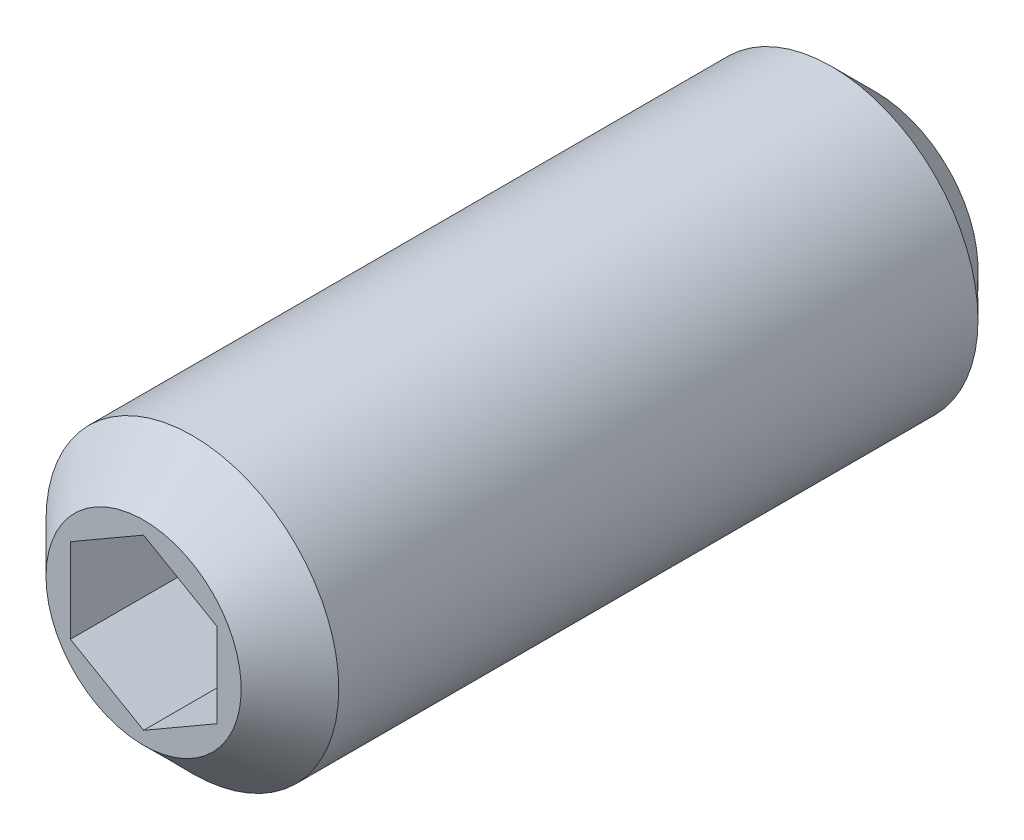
ISO-10303-21;
HEADER;
FILE_DESCRIPTION(('STEP AP214'),'2;1');
FILE_NAME('part.step','',(''),(''),'','','');
FILE_SCHEMA(('AUTOMOTIVE_DESIGN { 1 0 10303 214 1 1 1 1 }'));
ENDSEC;
DATA;
#1=APPLICATION_CONTEXT('core data for automotive mechanical design processes');
#2=APPLICATION_PROTOCOL_DEFINITION('international standard','automotive_design',2000,#1);
#3=PRODUCT_CONTEXT('',#1,'mechanical');
#4=PRODUCT('Part','Part','',(#3));
#5=PRODUCT_RELATED_PRODUCT_CATEGORY('part','',(#4));
#6=PRODUCT_DEFINITION_FORMATION('','',#4);
#7=PRODUCT_DEFINITION_CONTEXT('part definition',#1,'design');
#8=PRODUCT_DEFINITION('design','',#6,#7);
#9=PRODUCT_DEFINITION_SHAPE('','',#8);
#10=(LENGTH_UNIT() NAMED_UNIT(*) SI_UNIT(.MILLI.,.METRE.));
#11=(NAMED_UNIT(*) PLANE_ANGLE_UNIT() SI_UNIT($,.RADIAN.));
#12=(NAMED_UNIT(*) SI_UNIT($,.STERADIAN.) SOLID_ANGLE_UNIT());
#13=UNCERTAINTY_MEASURE_WITH_UNIT(LENGTH_MEASURE(1.E-05),#10,'distance_accuracy_value','');
#14=(GEOMETRIC_REPRESENTATION_CONTEXT(3) GLOBAL_UNCERTAINTY_ASSIGNED_CONTEXT((#13)) GLOBAL_UNIT_ASSIGNED_CONTEXT((#10,
#11,#12)) REPRESENTATION_CONTEXT('',''));
#15=CARTESIAN_POINT('',(0.,0.,0.));
#16=DIRECTION('',(0.,0.,1.));
#17=DIRECTION('',(1.,0.,0.));
#18=AXIS2_PLACEMENT_3D('',#15,#16,#17);
#19=CARTESIAN_POINT('',(3.73333323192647E-10,1.7397246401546E-08,1.75));
#20=DIRECTION('',(2.13333329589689E-10,-5.87163419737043E-11,1.));
#21=DIRECTION('',(0.,1.,5.87163419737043E-11));
#22=AXIS2_PLACEMENT_3D('',#19,#20,#21);
#23=SPHERICAL_SURFACE('',#22,1.75);
#24=CARTESIAN_POINT('',(0.,0.,0.));
#25=VERTEX_POINT('',#24);
#26=VERTEX_LOOP('',#25);
#27=FACE_BOUND('',#26,.T.);
#28=CARTESIAN_POINT('',(2.1333332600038E-10,1.74412836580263E-08,1.));
#29=DIRECTION('',(2.13333329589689E-10,-5.87163419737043E-11,1.));
#30=DIRECTION('',(1.,0.,-2.13333329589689E-10));
#31=AXIS2_PLACEMENT_3D('',#28,#29,#30);
#32=CIRCLE('',#31,1.58113883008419);
#33=CARTESIAN_POINT('',(1.58113883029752,1.74412836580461E-08,0.99999999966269));
#34=VERTEX_POINT('',#33);
#35=EDGE_CURVE('E18',#34,#34,#32,.F.);
#36=ORIENTED_EDGE('',*,*,#35,.T.);
#37=EDGE_LOOP('',(#36));
#38=FACE_BOUND('',#37,.T.);
#39=ADVANCED_FACE('F14',(#27,#38),#23,.T.);
#40=CARTESIAN_POINT('',(1.50000000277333,-1.75283540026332,12.9999999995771));
#41=DIRECTION('',(-2.13333329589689E-10,5.87163419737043E-11,-1.));
#42=DIRECTION('',(-1.,0.,2.13333329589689E-10));
#43=AXIS2_PLACEMENT_3D('',#40,#41,#42);
#44=PLANE('',#43);
#45=DIRECTION('',(-0.866025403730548,-0.500000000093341,1.5539391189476E-10));
#46=VECTOR('',#45,1.);
#47=CARTESIAN_POINT('',(-0.749999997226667,1.29903812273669,13.0000000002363));
#48=LINE('',#47,#46);
#49=CARTESIAN_POINT('',(2.35004088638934E-09,1.73205082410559,13.0000000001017));
#50=VERTEX_POINT('',#49);
#51=CARTESIAN_POINT('',(-1.49999999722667,0.866025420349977,13.0000000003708));
#52=VERTEX_POINT('',#51);
#53=EDGE_CURVE('E83',#50,#52,#48,.T.);
#54=ORIENTED_EDGE('',*,*,#53,.T.);
#55=DIRECTION('',(0.,-1.,-5.87163419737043E-11));
#56=VECTOR('',#55,1.);
#57=CARTESIAN_POINT('',(-1.49999999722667,1.6736687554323E-08,13.00000000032));
#58=LINE('',#57,#56);
#59=CARTESIAN_POINT('',(-1.49999999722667,-0.866025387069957,13.0000000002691));
#60=VERTEX_POINT('',#59);
#61=EDGE_CURVE('E77',#52,#60,#58,.T.);
#62=ORIENTED_EDGE('',*,*,#61,.T.);
#63=DIRECTION('',(0.866025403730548,-0.500000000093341,-2.14110253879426E-10));
#64=VECTOR('',#63,1.);
#65=CARTESIAN_POINT('',(-0.749999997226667,-1.29903808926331,13.0000000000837));
#66=LINE('',#65,#64);
#67=CARTESIAN_POINT('',(3.19662575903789E-09,-1.73205079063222,12.9999999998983));
#68=VERTEX_POINT('',#67);
#69=EDGE_CURVE('E80',#60,#68,#66,.T.);
#70=ORIENTED_EDGE('',*,*,#69,.T.);
#71=DIRECTION('',(0.866025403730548,0.500000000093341,-1.5539391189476E-10));
#72=VECTOR('',#71,1.);
#73=CARTESIAN_POINT('',(0.750000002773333,-1.29903808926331,12.9999999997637));
#74=LINE('',#73,#72);
#75=CARTESIAN_POINT('',(1.50000000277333,-0.866025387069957,12.9999999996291));
#76=VERTEX_POINT('',#75);
#77=EDGE_CURVE('E95',#68,#76,#74,.T.);
#78=ORIENTED_EDGE('',*,*,#77,.T.);
#79=DIRECTION('',(0.,1.,5.87163419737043E-11));
#80=VECTOR('',#79,1.);
#81=CARTESIAN_POINT('',(1.50000000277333,1.67366875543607E-08,12.99999999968));
#82=LINE('',#81,#80);
#83=CARTESIAN_POINT('',(1.50000000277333,0.866025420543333,12.9999999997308));
#84=VERTEX_POINT('',#83);
#85=EDGE_CURVE('E101',#76,#84,#82,.T.);
#86=ORIENTED_EDGE('',*,*,#85,.T.);
#87=DIRECTION('',(-0.866025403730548,0.500000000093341,2.14110253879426E-10));
#88=VECTOR('',#87,1.);
#89=CARTESIAN_POINT('',(0.750000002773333,1.29903812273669,12.9999999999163));
#90=LINE('',#89,#88);
#91=EDGE_CURVE('E104',#84,#50,#90,.T.);
#92=ORIENTED_EDGE('',*,*,#91,.T.);
#93=EDGE_LOOP('',(#54,#62,#70,#78,#86,#92));
#94=FACE_BOUND('',#93,.T.);
#95=ADVANCED_FACE('F78',(#94),#44,.F.);
#96=CARTESIAN_POINT('',(-2.12519999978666,-2.13251273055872,1.00000000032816));
#97=DIRECTION('',(2.13333329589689E-10,-5.87163419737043E-11,1.));
#98=DIRECTION('',(1.,0.,-2.13333329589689E-10));
#99=AXIS2_PLACEMENT_3D('',#96,#97,#98);
#100=PLANE('',#99);
#101=ORIENTED_EDGE('',*,*,#35,.F.);
#102=EDGE_LOOP('',(#101));
#103=FACE_BOUND('',#102,.T.);
#104=CARTESIAN_POINT('',(2.1333332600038E-10,1.74412836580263E-08,1.));
#105=DIRECTION('',(2.13333329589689E-10,-5.87167550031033E-11,1.));
#106=DIRECTION('',(0.,1.,5.87167550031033E-11));
#107=AXIS2_PLACEMENT_3D('',#104,#105,#106);
#108=CIRCLE('',#107,2.1);
#109=CARTESIAN_POINT('',(2.1333332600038E-10,2.10000001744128,1.00000000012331));
#110=VERTEX_POINT('',#109);
#111=EDGE_CURVE('E121',#110,#110,#108,.T.);
#112=ORIENTED_EDGE('',*,*,#111,.F.);
#113=EDGE_LOOP('',(#112));
#114=FACE_BOUND('',#113,.T.);
#115=ADVANCED_FACE('F134',(#103,#114),#100,.F.);
#116=CARTESIAN_POINT('',(-1.49999999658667,-0.866025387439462,16.0000000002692));
#117=DIRECTION('',(-1.,0.,2.13333329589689E-10));
#118=DIRECTION('',(0.,1.,5.87163419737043E-11));
#119=AXIS2_PLACEMENT_3D('',#116,#117,#118);
#120=PLANE('',#119);
#121=DIRECTION('',(-2.13333329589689E-10,5.87163419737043E-11,-1.));
#122=VECTOR('',#121,1.);
#123=CARTESIAN_POINT('',(-1.49999999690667,-0.866025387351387,14.5000000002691));
#124=LINE('',#123,#122);
#125=CARTESIAN_POINT('',(-1.49999999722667,-0.866025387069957,16.0000000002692));
#126=VERTEX_POINT('',#125);
#127=EDGE_CURVE('E84',#126,#60,#124,.T.);
#128=ORIENTED_EDGE('',*,*,#127,.T.);
#129=ORIENTED_EDGE('',*,*,#61,.F.);
#130=DIRECTION('',(2.13333329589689E-10,-5.87163419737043E-11,1.));
#131=VECTOR('',#130,1.);
#132=CARTESIAN_POINT('',(-1.49999999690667,0.866025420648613,14.5000000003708));
#133=LINE('',#132,#131);
#134=CARTESIAN_POINT('',(-1.49999999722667,0.866025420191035,16.0000000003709));
#135=VERTEX_POINT('',#134);
#136=EDGE_CURVE('E54',#52,#135,#133,.T.);
#137=ORIENTED_EDGE('',*,*,#136,.T.);
#138=DIRECTION('',(0.,-1.,-5.87163419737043E-11));
#139=VECTOR('',#138,1.);
#140=CARTESIAN_POINT('',(-1.49999999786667,1.65605385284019E-08,16.00000000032));
#141=LINE('',#140,#139);
#142=EDGE_CURVE('E48',#135,#126,#141,.T.);
#143=ORIENTED_EDGE('',*,*,#142,.T.);
#144=EDGE_LOOP('',(#128,#129,#137,#143));
#145=FACE_BOUND('',#144,.T.);
#146=ADVANCED_FACE('F86',(#145),#120,.F.);
#147=CARTESIAN_POINT('',(3.41333326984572E-09,-1.73205079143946,15.9999999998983));
#148=DIRECTION('',(-0.500000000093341,-0.866025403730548,5.58168210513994E-11));
#149=DIRECTION('',(-0.866025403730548,0.500000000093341,2.14110253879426E-10));
#150=AXIS2_PLACEMENT_3D('',#147,#148,#149);
#151=PLANE('',#150);
#152=DIRECTION('',(-2.13333329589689E-10,5.87163419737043E-11,-1.));
#153=VECTOR('',#152,1.);
#154=CARTESIAN_POINT('',(3.09333327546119E-09,-1.73205079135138,14.4999999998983));
#155=LINE('',#154,#153);
#156=CARTESIAN_POINT('',(3.41333311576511E-09,-1.73205079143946,15.9999999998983));
#157=VERTEX_POINT('',#156);
#158=EDGE_CURVE('E92',#157,#68,#155,.T.);
#159=ORIENTED_EDGE('',*,*,#158,.T.);
#160=ORIENTED_EDGE('',*,*,#69,.F.);
#161=ORIENTED_EDGE('',*,*,#127,.F.);
#162=DIRECTION('',(-0.866025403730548,0.500000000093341,2.14110253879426E-10));
#163=VECTOR('',#162,1.);
#164=CARTESIAN_POINT('',(3.41333326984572E-09,-1.73205079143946,15.9999999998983));
#165=LINE('',#164,#163);
#166=EDGE_CURVE('E120',#126,#157,#165,.F.);
#167=ORIENTED_EDGE('',*,*,#166,.T.);
#168=EDGE_LOOP('',(#159,#160,#161,#167));
#169=FACE_BOUND('',#168,.T.);
#170=ADVANCED_FACE('F90',(#169),#151,.F.);
#171=CARTESIAN_POINT('',(1.50000000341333,-0.866025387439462,15.9999999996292));
#172=DIRECTION('',(0.500000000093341,-0.866025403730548,-1.57516508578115E-10));
#173=DIRECTION('',(-0.866025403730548,-0.500000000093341,1.5539391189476E-10));
#174=AXIS2_PLACEMENT_3D('',#171,#172,#173);
#175=PLANE('',#174);
#176=DIRECTION('',(-2.13333329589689E-10,5.87163419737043E-11,-1.));
#177=VECTOR('',#176,1.);
#178=CARTESIAN_POINT('',(1.50000000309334,-0.866025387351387,14.4999999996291));
#179=LINE('',#178,#177);
#180=CARTESIAN_POINT('',(1.50000000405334,-0.866025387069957,15.9999999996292));
#181=VERTEX_POINT('',#180);
#182=EDGE_CURVE('E100',#181,#76,#179,.T.);
#183=ORIENTED_EDGE('',*,*,#182,.T.);
#184=ORIENTED_EDGE('',*,*,#77,.F.);
#185=ORIENTED_EDGE('',*,*,#158,.F.);
#186=DIRECTION('',(-0.866025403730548,-0.500000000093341,1.5539391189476E-10));
#187=VECTOR('',#186,1.);
#188=CARTESIAN_POINT('',(1.50000000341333,-0.866025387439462,15.9999999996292));
#189=LINE('',#188,#187);
#190=EDGE_CURVE('E114',#157,#181,#189,.F.);
#191=ORIENTED_EDGE('',*,*,#190,.T.);
#192=EDGE_LOOP('',(#183,#184,#185,#191));
#193=FACE_BOUND('',#192,.T.);
#194=ADVANCED_FACE('F237',(#193),#175,.F.);
#195=CARTESIAN_POINT('',(1.50000000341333,0.866025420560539,15.9999999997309));
#196=DIRECTION('',(1.,0.,-2.13333329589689E-10));
#197=DIRECTION('',(0.,-1.,-5.87163419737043E-11));
#198=AXIS2_PLACEMENT_3D('',#195,#196,#197);
#199=PLANE('',#198);
#200=DIRECTION('',(-2.13333329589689E-10,5.87163419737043E-11,-1.));
#201=VECTOR('',#200,1.);
#202=CARTESIAN_POINT('',(1.50000000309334,0.866025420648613,14.4999999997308));
#203=LINE('',#202,#201);
#204=CARTESIAN_POINT('',(1.50000000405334,0.866025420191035,15.9999999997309));
#205=VERTEX_POINT('',#204);
#206=EDGE_CURVE('E103',#205,#84,#203,.T.);
#207=ORIENTED_EDGE('',*,*,#206,.T.);
#208=ORIENTED_EDGE('',*,*,#85,.F.);
#209=ORIENTED_EDGE('',*,*,#182,.F.);
#210=DIRECTION('',(0.,1.,5.87163419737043E-11));
#211=VECTOR('',#210,1.);
#212=CARTESIAN_POINT('',(1.50000000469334,1.65605385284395E-08,15.99999999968));
#213=LINE('',#212,#211);
#214=EDGE_CURVE('E112',#181,#205,#213,.T.);
#215=ORIENTED_EDGE('',*,*,#214,.T.);
#216=EDGE_LOOP('',(#207,#208,#209,#215));
#217=FACE_BOUND('',#216,.T.);
#218=ADVANCED_FACE('F228',(#217),#199,.F.);
#219=CARTESIAN_POINT('',(3.41333326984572E-09,1.73205082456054,16.0000000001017));
#220=DIRECTION('',(0.500000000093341,0.866025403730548,-5.58168210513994E-11));
#221=DIRECTION('',(0.866025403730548,-0.500000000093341,-2.14110253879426E-10));
#222=AXIS2_PLACEMENT_3D('',#219,#220,#221);
#223=PLANE('',#222);
#224=DIRECTION('',(-2.13333329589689E-10,5.87163419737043E-11,-1.));
#225=VECTOR('',#224,1.);
#226=CARTESIAN_POINT('',(3.09333327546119E-09,1.73205082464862,14.5000000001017));
#227=LINE('',#226,#225);
#228=CARTESIAN_POINT('',(3.41333342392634E-09,1.73205082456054,16.0000000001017));
#229=VERTEX_POINT('',#228);
#230=EDGE_CURVE('E106',#229,#50,#227,.T.);
#231=ORIENTED_EDGE('',*,*,#230,.T.);
#232=ORIENTED_EDGE('',*,*,#91,.F.);
#233=ORIENTED_EDGE('',*,*,#206,.F.);
#234=DIRECTION('',(0.866025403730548,-0.500000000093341,-2.14110253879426E-10));
#235=VECTOR('',#234,1.);
#236=CARTESIAN_POINT('',(3.41333326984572E-09,1.73205082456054,16.0000000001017));
#237=LINE('',#236,#235);
#238=EDGE_CURVE('E33',#205,#229,#237,.F.);
#239=ORIENTED_EDGE('',*,*,#238,.T.);
#240=EDGE_LOOP('',(#231,#232,#233,#239));
#241=FACE_BOUND('',#240,.T.);
#242=ADVANCED_FACE('F222',(#241),#223,.F.);
#243=CARTESIAN_POINT('',(-1.49999999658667,0.866025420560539,16.0000000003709));
#244=DIRECTION('',(-0.500000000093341,0.866025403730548,1.57516508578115E-10));
#245=DIRECTION('',(0.866025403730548,0.500000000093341,-1.5539391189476E-10));
#246=AXIS2_PLACEMENT_3D('',#243,#244,#245);
#247=PLANE('',#246);
#248=ORIENTED_EDGE('',*,*,#136,.F.);
#249=ORIENTED_EDGE('',*,*,#53,.F.);
#250=ORIENTED_EDGE('',*,*,#230,.F.);
#251=DIRECTION('',(0.866025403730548,0.500000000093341,-1.5539391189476E-10));
#252=VECTOR('',#251,1.);
#253=CARTESIAN_POINT('',(-1.49999999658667,0.866025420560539,16.0000000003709));
#254=LINE('',#253,#252);
#255=EDGE_CURVE('E110',#229,#135,#254,.F.);
#256=ORIENTED_EDGE('',*,*,#255,.T.);
#257=EDGE_LOOP('',(#248,#249,#250,#256));
#258=FACE_BOUND('',#257,.T.);
#259=ADVANCED_FACE('F162',(#258),#247,.F.);
#260=CARTESIAN_POINT('',(2.1333332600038E-10,1.74412836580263E-08,1.));
#261=DIRECTION('',(2.13333329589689E-10,-5.87167550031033E-11,1.));
#262=DIRECTION('',(0.,1.,5.87167550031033E-11));
#263=AXIS2_PLACEMENT_3D('',#260,#261,#262);
#264=CONICAL_SURFACE('',#263,2.1,0.785398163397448);
#265=CARTESIAN_POINT('',(4.053333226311E-10,1.738843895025E-08,1.9));
#266=DIRECTION('',(2.13333329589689E-10,-5.87163419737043E-11,1.));
#267=DIRECTION('',(1.,0.,-2.13333329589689E-10));
#268=AXIS2_PLACEMENT_3D('',#265,#266,#267);
#269=CIRCLE('',#268,3.);
#270=CARTESIAN_POINT('',(3.00000000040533,1.73884389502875E-08,1.89999999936));
#271=VERTEX_POINT('',#270);
#272=EDGE_CURVE('E108',#271,#271,#269,.T.);
#273=ORIENTED_EDGE('',*,*,#272,.F.);
#274=EDGE_LOOP('',(#273));
#275=FACE_BOUND('',#274,.T.);
#276=ORIENTED_EDGE('',*,*,#111,.T.);
#277=EDGE_LOOP('',(#276));
#278=FACE_BOUND('',#277,.T.);
#279=ADVANCED_FACE('F132',(#275,#278),#264,.T.);
#280=CARTESIAN_POINT('',(2.02400000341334,-2.03096450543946,15.9999999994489));
#281=DIRECTION('',(-2.13333329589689E-10,5.87163419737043E-11,-1.));
#282=DIRECTION('',(-1.,0.,2.13333329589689E-10));
#283=AXIS2_PLACEMENT_3D('',#280,#281,#282);
#284=PLANE('',#283);
#285=ORIENTED_EDGE('',*,*,#238,.F.);
#286=ORIENTED_EDGE('',*,*,#214,.F.);
#287=ORIENTED_EDGE('',*,*,#190,.F.);
#288=ORIENTED_EDGE('',*,*,#166,.F.);
#289=ORIENTED_EDGE('',*,*,#142,.F.);
#290=ORIENTED_EDGE('',*,*,#255,.F.);
#291=EDGE_LOOP('',(#285,#286,#287,#288,#289,#290));
#292=FACE_BOUND('',#291,.T.);
#293=CARTESIAN_POINT('',(3.41333326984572E-09,1.65605385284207E-08,16.));
#294=DIRECTION('',(-2.13333329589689E-10,5.87163419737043E-11,-1.));
#295=DIRECTION('',(-1.,0.,2.13333329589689E-10));
#296=AXIS2_PLACEMENT_3D('',#293,#294,#295);
#297=CIRCLE('',#296,2.);
#298=CARTESIAN_POINT('',(-1.99999999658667,1.65605385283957E-08,16.0000000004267));
#299=VERTEX_POINT('',#298);
#300=EDGE_CURVE('E24',#299,#299,#297,.T.);
#301=ORIENTED_EDGE('',*,*,#300,.F.);
#302=EDGE_LOOP('',(#301));
#303=FACE_BOUND('',#302,.T.);
#304=ADVANCED_FACE('F16',(#292,#303),#284,.F.);
#305=CARTESIAN_POINT('',(4.053333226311E-10,1.738843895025E-08,1.9));
#306=DIRECTION('',(2.13333329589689E-10,-5.87166310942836E-11,1.));
#307=DIRECTION('',(0.,1.,5.87166310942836E-11));
#308=AXIS2_PLACEMENT_3D('',#305,#306,#307);
#309=CYLINDRICAL_SURFACE('',#308,3.);
#310=CARTESIAN_POINT('',(3.19999994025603E-09,1.66192548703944E-08,15.));
#311=DIRECTION('',(-2.13333329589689E-10,5.87163419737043E-11,-1.));
#312=DIRECTION('',(-1.,0.,2.13333329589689E-10));
#313=AXIS2_PLACEMENT_3D('',#310,#311,#312);
#314=CIRCLE('',#313,3.);
#315=CARTESIAN_POINT('',(-2.9999999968,1.66192548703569E-08,15.00000000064));
#316=VERTEX_POINT('',#315);
#317=EDGE_CURVE('E9',#316,#316,#314,.F.);
#318=ORIENTED_EDGE('',*,*,#317,.F.);
#319=EDGE_LOOP('',(#318));
#320=FACE_BOUND('',#319,.T.);
#321=ORIENTED_EDGE('',*,*,#272,.T.);
#322=EDGE_LOOP('',(#321));
#323=FACE_BOUND('',#322,.T.);
#324=ADVANCED_FACE('F149',(#320,#323),#309,.T.);
#325=CARTESIAN_POINT('',(3.41333326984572E-09,1.65605385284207E-08,16.));
#326=DIRECTION('',(-2.13333329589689E-10,5.87163419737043E-11,-1.));
#327=DIRECTION('',(-1.,0.,2.13333329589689E-10));
#328=AXIS2_PLACEMENT_3D('',#325,#326,#327);
#329=CONICAL_SURFACE('',#328,2.,0.785398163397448);
#330=ORIENTED_EDGE('',*,*,#317,.T.);
#331=EDGE_LOOP('',(#330));
#332=FACE_BOUND('',#331,.T.);
#333=ORIENTED_EDGE('',*,*,#300,.T.);
#334=EDGE_LOOP('',(#333));
#335=FACE_BOUND('',#334,.T.);
#336=ADVANCED_FACE('F147',(#332,#335),#329,.T.);
#337=CLOSED_SHELL('',(#39,#95,#115,#146,#170,#194,#218,#242,#259,#279,#304,#324,#336));
#338=MANIFOLD_SOLID_BREP('B1',#337);
#339=ADVANCED_BREP_SHAPE_REPRESENTATION('',(#18,#338),#14);
#340=SHAPE_DEFINITION_REPRESENTATION(#9,#339);
ENDSEC;
END-ISO-10303-21;
